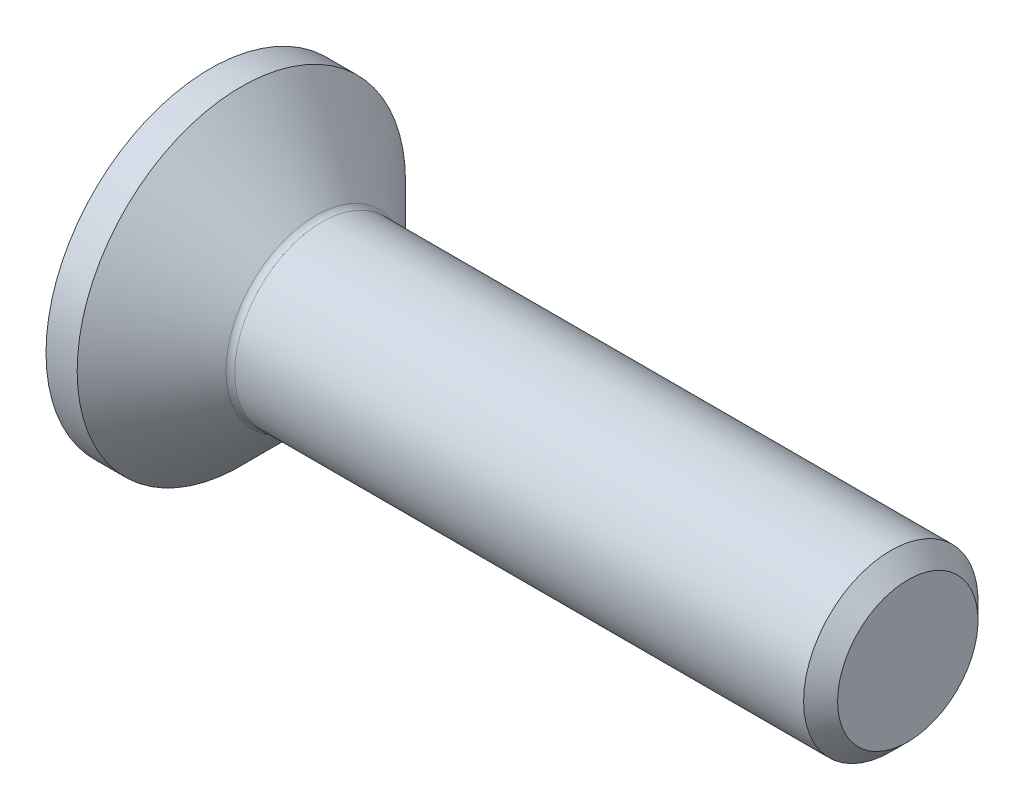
from build123d import *

# Parameters (mm, degrees)
FILLET1_R   = 0.2
HEX_2_DEPTH = 1.5


with BuildPart() as part:
    # BodySke → BaseBody (revolve)
    with BuildSketch(Plane.XY, mode=Mode.PRIVATE) as basebody_sk:
        Polygon((0, 0), (0, 3.765), (0.715, 3.765), (2.48, 2), (15.61, 2), (16, 1.61), (16, 0), align=None)
    revolve(basebody_sk.sketch.rotate(Axis((0, 0, 0), (1, 0, 0)), 90), axis=Axis((0, 0, 0), (1, 0, 0)))

    # Fillet1
    fillet1_edges = [part.edges().sort_by_distance(p)[0] for p in [
        (2.48, 0, -2),
    ]]
    fillet(fillet1_edges, radius=FILLET1_R)

    # Sketch2 → PreBroach (revolve, cut)
    with BuildSketch(Plane.XY, mode=Mode.PRIVATE) as prebroach_sk:
        Polygon((0, 1.25), (1.5, 1.25), (2.221687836, 0), (0, 0), align=None)
    revolve(prebroach_sk.sketch.rotate(Axis((0, 0, 0), (1, 0, 0)), 90), axis=Axis((0, 0, 0), (1, 0, 0)), mode=Mode.SUBTRACT)

    # Sketch3 → Hex 2 (cut)
    with BuildSketch(Plane.ZY):
        Polygon((-1.25, -0.721687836), (-1.25, 0.721687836), (0, 1.443375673), (1.25, 0.721687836), (1.25, -0.721687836), (0, -1.443375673), align=None)
    extrude(amount=-HEX_2_DEPTH, mode=Mode.SUBTRACT)


solid = part.part
